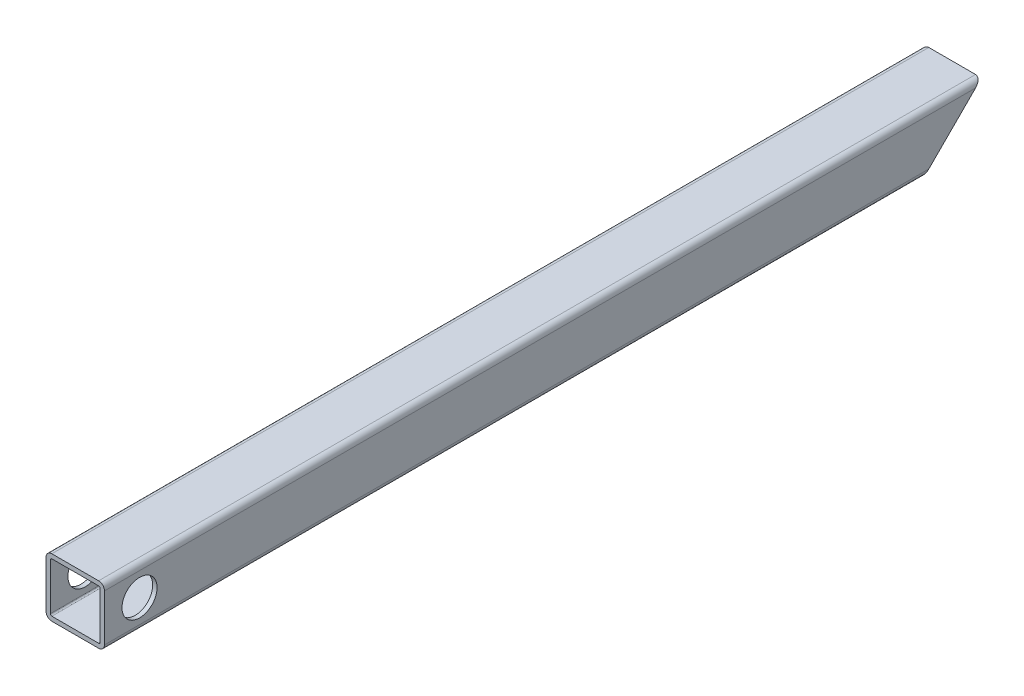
ISO-10303-21;
HEADER;
FILE_DESCRIPTION(('STEP AP214'),'2;1');
FILE_NAME('part.step','',(''),(''),'','','');
FILE_SCHEMA(('AUTOMOTIVE_DESIGN { 1 0 10303 214 1 1 1 1 }'));
ENDSEC;
DATA;
#1=APPLICATION_CONTEXT('core data for automotive mechanical design processes');
#2=APPLICATION_PROTOCOL_DEFINITION('international standard','automotive_design',2000,#1);
#3=PRODUCT_CONTEXT('',#1,'mechanical');
#4=PRODUCT('Part','Part','',(#3));
#5=PRODUCT_RELATED_PRODUCT_CATEGORY('part','',(#4));
#6=PRODUCT_DEFINITION_FORMATION('','',#4);
#7=PRODUCT_DEFINITION_CONTEXT('part definition',#1,'design');
#8=PRODUCT_DEFINITION('design','',#6,#7);
#9=PRODUCT_DEFINITION_SHAPE('','',#8);
#10=(LENGTH_UNIT() NAMED_UNIT(*) SI_UNIT(.MILLI.,.METRE.));
#11=(NAMED_UNIT(*) PLANE_ANGLE_UNIT() SI_UNIT($,.RADIAN.));
#12=(NAMED_UNIT(*) SI_UNIT($,.STERADIAN.) SOLID_ANGLE_UNIT());
#13=UNCERTAINTY_MEASURE_WITH_UNIT(LENGTH_MEASURE(1.E-05),#10,'distance_accuracy_value','');
#14=(GEOMETRIC_REPRESENTATION_CONTEXT(3) GLOBAL_UNCERTAINTY_ASSIGNED_CONTEXT((#13)) GLOBAL_UNIT_ASSIGNED_CONTEXT((#10,
#11,#12)) REPRESENTATION_CONTEXT('',''));
#15=CARTESIAN_POINT('',(0.,0.,0.));
#16=DIRECTION('',(0.,0.,1.));
#17=DIRECTION('',(1.,0.,0.));
#18=AXIS2_PLACEMENT_3D('',#15,#16,#17);
#19=CARTESIAN_POINT('',(-10.,0.,300.));
#20=DIRECTION('',(1.,0.,0.));
#21=DIRECTION('',(0.,0.,-1.));
#22=AXIS2_PLACEMENT_3D('',#19,#20,#21);
#23=PLANE('',#22);
#24=CARTESIAN_POINT('',(-10.,10.,288.));
#25=DIRECTION('',(1.,0.,0.));
#26=DIRECTION('',(0.,1.,0.));
#27=AXIS2_PLACEMENT_3D('',#24,#25,#26);
#28=CIRCLE('',#27,5.99999999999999);
#29=CARTESIAN_POINT('',(-10.,16.,288.));
#30=VERTEX_POINT('',#29);
#31=EDGE_CURVE('E459',#30,#30,#28,.T.);
#32=ORIENTED_EDGE('',*,*,#31,.T.);
#33=EDGE_LOOP('',(#32));
#34=FACE_BOUND('',#33,.T.);
#35=DIRECTION('',(0.,0.707106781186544,-0.707106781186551));
#36=VECTOR('',#35,1.);
#37=CARTESIAN_POINT('',(-10.,-140.,160.000000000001));
#38=LINE('',#37,#36);
#39=CARTESIAN_POINT('',(-10.,2.,18.0000000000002));
#40=VERTEX_POINT('',#39);
#41=CARTESIAN_POINT('',(-10.,18.,2.));
#42=VERTEX_POINT('',#41);
#43=EDGE_CURVE('E254',#40,#42,#38,.T.);
#44=ORIENTED_EDGE('',*,*,#43,.F.);
#45=DIRECTION('',(0.,0.,-1.));
#46=VECTOR('',#45,1.);
#47=CARTESIAN_POINT('',(-10.,2.,300.));
#48=LINE('',#47,#46);
#49=CARTESIAN_POINT('',(-10.,2.,300.));
#50=VERTEX_POINT('',#49);
#51=EDGE_CURVE('E188',#40,#50,#48,.F.);
#52=ORIENTED_EDGE('',*,*,#51,.T.);
#53=DIRECTION('',(0.,-1.,0.));
#54=VECTOR('',#53,1.);
#55=CARTESIAN_POINT('',(-10.,0.,300.));
#56=LINE('',#55,#54);
#57=CARTESIAN_POINT('',(-10.,18.,300.));
#58=VERTEX_POINT('',#57);
#59=EDGE_CURVE('E268',#58,#50,#56,.T.);
#60=ORIENTED_EDGE('',*,*,#59,.F.);
#61=DIRECTION('',(0.,0.,-1.));
#62=VECTOR('',#61,1.);
#63=CARTESIAN_POINT('',(-10.,18.,300.));
#64=LINE('',#63,#62);
#65=EDGE_CURVE('E185',#58,#42,#64,.T.);
#66=ORIENTED_EDGE('',*,*,#65,.T.);
#67=EDGE_LOOP('',(#44,#52,#60,#66));
#68=FACE_BOUND('',#67,.T.);
#69=ADVANCED_FACE('F32',(#34,#68),#23,.F.);
#70=CARTESIAN_POINT('',(-10.,0.,300.));
#71=DIRECTION('',(0.,1.,0.));
#72=DIRECTION('',(-1.,0.,0.));
#73=AXIS2_PLACEMENT_3D('',#70,#71,#72);
#74=PLANE('',#73);
#75=DIRECTION('',(1.,0.,0.));
#76=VECTOR('',#75,1.);
#77=CARTESIAN_POINT('',(-10.,0.,300.));
#78=LINE('',#77,#76);
#79=CARTESIAN_POINT('',(-8.,0.,300.));
#80=VERTEX_POINT('',#79);
#81=CARTESIAN_POINT('',(8.,0.,300.));
#82=VERTEX_POINT('',#81);
#83=EDGE_CURVE('E271',#80,#82,#78,.T.);
#84=ORIENTED_EDGE('',*,*,#83,.F.);
#85=DIRECTION('',(0.,0.,-1.));
#86=VECTOR('',#85,1.);
#87=CARTESIAN_POINT('',(-8.,0.,300.));
#88=LINE('',#87,#86);
#89=CARTESIAN_POINT('',(-8.00000000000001,0.,20.0000000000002));
#90=VERTEX_POINT('',#89);
#91=EDGE_CURVE('E165',#80,#90,#88,.T.);
#92=ORIENTED_EDGE('',*,*,#91,.T.);
#93=DIRECTION('',(-1.,0.,0.));
#94=VECTOR('',#93,1.);
#95=CARTESIAN_POINT('',(411.662979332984,0.,20.0000000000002));
#96=LINE('',#95,#94);
#97=CARTESIAN_POINT('',(8.00000000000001,0.,20.0000000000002));
#98=VERTEX_POINT('',#97);
#99=EDGE_CURVE('E148',#98,#90,#96,.T.);
#100=ORIENTED_EDGE('',*,*,#99,.F.);
#101=DIRECTION('',(0.,0.,-1.));
#102=VECTOR('',#101,1.);
#103=CARTESIAN_POINT('',(8.,0.,300.));
#104=LINE('',#103,#102);
#105=EDGE_CURVE('E162',#98,#82,#104,.F.);
#106=ORIENTED_EDGE('',*,*,#105,.T.);
#107=EDGE_LOOP('',(#84,#92,#100,#106));
#108=FACE_BOUND('',#107,.T.);
#109=ADVANCED_FACE('F161',(#108),#74,.F.);
#110=CARTESIAN_POINT('',(10.,0.,300.));
#111=DIRECTION('',(-1.,0.,0.));
#112=DIRECTION('',(0.,-1.,0.));
#113=AXIS2_PLACEMENT_3D('',#110,#111,#112);
#114=PLANE('',#113);
#115=CARTESIAN_POINT('',(10.,10.,288.));
#116=DIRECTION('',(1.,0.,0.));
#117=DIRECTION('',(0.,1.,0.));
#118=AXIS2_PLACEMENT_3D('',#115,#116,#117);
#119=CIRCLE('',#118,5.99999999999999);
#120=CARTESIAN_POINT('',(10.,16.,288.));
#121=VERTEX_POINT('',#120);
#122=EDGE_CURVE('E456',#121,#121,#119,.T.);
#123=ORIENTED_EDGE('',*,*,#122,.F.);
#124=EDGE_LOOP('',(#123));
#125=FACE_BOUND('',#124,.T.);
#126=DIRECTION('',(0.,1.,0.));
#127=VECTOR('',#126,1.);
#128=CARTESIAN_POINT('',(10.,0.,300.));
#129=LINE('',#128,#127);
#130=CARTESIAN_POINT('',(10.,2.,300.));
#131=VERTEX_POINT('',#130);
#132=CARTESIAN_POINT('',(10.,18.,300.));
#133=VERTEX_POINT('',#132);
#134=EDGE_CURVE('E273',#131,#133,#129,.T.);
#135=ORIENTED_EDGE('',*,*,#134,.F.);
#136=DIRECTION('',(0.,0.,-1.));
#137=VECTOR('',#136,1.);
#138=CARTESIAN_POINT('',(10.,2.,300.));
#139=LINE('',#138,#137);
#140=CARTESIAN_POINT('',(10.,2.,18.0000000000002));
#141=VERTEX_POINT('',#140);
#142=EDGE_CURVE('E199',#131,#141,#139,.T.);
#143=ORIENTED_EDGE('',*,*,#142,.T.);
#144=DIRECTION('',(0.,-0.707106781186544,0.707106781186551));
#145=VECTOR('',#144,1.);
#146=CARTESIAN_POINT('',(9.99999999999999,-140.,160.000000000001));
#147=LINE('',#146,#145);
#148=CARTESIAN_POINT('',(10.,18.,2.));
#149=VERTEX_POINT('',#148);
#150=EDGE_CURVE('E150',#149,#141,#147,.T.);
#151=ORIENTED_EDGE('',*,*,#150,.F.);
#152=DIRECTION('',(0.,0.,-1.));
#153=VECTOR('',#152,1.);
#154=CARTESIAN_POINT('',(10.,18.,300.));
#155=LINE('',#154,#153);
#156=EDGE_CURVE('E197',#149,#133,#155,.F.);
#157=ORIENTED_EDGE('',*,*,#156,.T.);
#158=EDGE_LOOP('',(#135,#143,#151,#157));
#159=FACE_BOUND('',#158,.T.);
#160=ADVANCED_FACE('F301',(#125,#159),#114,.F.);
#161=CARTESIAN_POINT('',(-8.5,1.5,300.));
#162=DIRECTION('',(1.,0.,0.));
#163=DIRECTION('',(0.,0.,-1.));
#164=AXIS2_PLACEMENT_3D('',#161,#162,#163);
#165=PLANE('',#164);
#166=CARTESIAN_POINT('',(-8.5,10.,288.));
#167=DIRECTION('',(1.,0.,0.));
#168=DIRECTION('',(0.,0.,-1.));
#169=AXIS2_PLACEMENT_3D('',#166,#167,#168);
#170=CIRCLE('',#169,5.99999999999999);
#171=CARTESIAN_POINT('',(-8.5,10.,282.));
#172=VERTEX_POINT('',#171);
#173=EDGE_CURVE('E167',#172,#172,#170,.T.);
#174=ORIENTED_EDGE('',*,*,#173,.F.);
#175=EDGE_LOOP('',(#174));
#176=FACE_BOUND('',#175,.T.);
#177=DIRECTION('',(0.,0.707106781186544,-0.707106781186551));
#178=VECTOR('',#177,1.);
#179=CARTESIAN_POINT('',(-8.5,-139.25,159.250000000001));
#180=LINE('',#179,#178);
#181=CARTESIAN_POINT('',(-8.5,2.,18.0000000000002));
#182=VERTEX_POINT('',#181);
#183=CARTESIAN_POINT('',(-8.5,18.,2.00000000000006));
#184=VERTEX_POINT('',#183);
#185=EDGE_CURVE('E241',#182,#184,#180,.T.);
#186=ORIENTED_EDGE('',*,*,#185,.T.);
#187=DIRECTION('',(0.,0.,-1.));
#188=VECTOR('',#187,1.);
#189=CARTESIAN_POINT('',(-8.5,18.,300.));
#190=LINE('',#189,#188);
#191=CARTESIAN_POINT('',(-8.5,18.,300.));
#192=VERTEX_POINT('',#191);
#193=EDGE_CURVE('E52',#184,#192,#190,.F.);
#194=ORIENTED_EDGE('',*,*,#193,.T.);
#195=DIRECTION('',(0.,-1.,0.));
#196=VECTOR('',#195,1.);
#197=CARTESIAN_POINT('',(-8.5,1.5,300.));
#198=LINE('',#197,#196);
#199=CARTESIAN_POINT('',(-8.5,2.,300.));
#200=VERTEX_POINT('',#199);
#201=EDGE_CURVE('E251',#192,#200,#198,.T.);
#202=ORIENTED_EDGE('',*,*,#201,.T.);
#203=DIRECTION('',(0.,0.,-1.));
#204=VECTOR('',#203,1.);
#205=CARTESIAN_POINT('',(-8.5,2.,18.5000000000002));
#206=LINE('',#205,#204);
#207=EDGE_CURVE('E221',#200,#182,#206,.T.);
#208=ORIENTED_EDGE('',*,*,#207,.T.);
#209=EDGE_LOOP('',(#186,#194,#202,#208));
#210=FACE_BOUND('',#209,.T.);
#211=ADVANCED_FACE('F250',(#176,#210),#165,.T.);
#212=CARTESIAN_POINT('',(-8.5,1.5,300.));
#213=DIRECTION('',(0.,1.,0.));
#214=DIRECTION('',(0.,0.,1.));
#215=AXIS2_PLACEMENT_3D('',#212,#213,#214);
#216=PLANE('',#215);
#217=DIRECTION('',(1.,0.,0.));
#218=VECTOR('',#217,1.);
#219=CARTESIAN_POINT('',(-8.5,1.5,300.));
#220=LINE('',#219,#218);
#221=CARTESIAN_POINT('',(-8.,1.5,300.));
#222=VERTEX_POINT('',#221);
#223=CARTESIAN_POINT('',(8.,1.5,300.));
#224=VERTEX_POINT('',#223);
#225=EDGE_CURVE('E253',#222,#224,#220,.T.);
#226=ORIENTED_EDGE('',*,*,#225,.T.);
#227=DIRECTION('',(0.,0.,-1.));
#228=VECTOR('',#227,1.);
#229=CARTESIAN_POINT('',(8.,1.5,18.5000000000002));
#230=LINE('',#229,#228);
#231=CARTESIAN_POINT('',(8.,1.5,18.5000000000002));
#232=VERTEX_POINT('',#231);
#233=EDGE_CURVE('E208',#224,#232,#230,.T.);
#234=ORIENTED_EDGE('',*,*,#233,.T.);
#235=DIRECTION('',(-1.,0.,0.));
#236=VECTOR('',#235,1.);
#237=CARTESIAN_POINT('',(-8.50000000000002,1.5,18.5000000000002));
#238=LINE('',#237,#236);
#239=CARTESIAN_POINT('',(-8.,1.5,18.5000000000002));
#240=VERTEX_POINT('',#239);
#241=EDGE_CURVE('E240',#232,#240,#238,.T.);
#242=ORIENTED_EDGE('',*,*,#241,.T.);
#243=DIRECTION('',(0.,0.,-1.));
#244=VECTOR('',#243,1.);
#245=CARTESIAN_POINT('',(-8.,1.5,300.));
#246=LINE('',#245,#244);
#247=EDGE_CURVE('E206',#240,#222,#246,.F.);
#248=ORIENTED_EDGE('',*,*,#247,.T.);
#249=EDGE_LOOP('',(#226,#234,#242,#248));
#250=FACE_BOUND('',#249,.T.);
#251=ADVANCED_FACE('F247',(#250),#216,.T.);
#252=CARTESIAN_POINT('',(8.5,1.5,300.));
#253=DIRECTION('',(-1.,0.,0.));
#254=DIRECTION('',(0.,0.,1.));
#255=AXIS2_PLACEMENT_3D('',#252,#253,#254);
#256=PLANE('',#255);
#257=CARTESIAN_POINT('',(8.5,10.,288.));
#258=DIRECTION('',(-1.,0.,0.));
#259=DIRECTION('',(0.,0.,1.));
#260=AXIS2_PLACEMENT_3D('',#257,#258,#259);
#261=CIRCLE('',#260,5.99999999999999);
#262=CARTESIAN_POINT('',(8.5,10.,294.));
#263=VERTEX_POINT('',#262);
#264=EDGE_CURVE('E180',#263,#263,#261,.T.);
#265=ORIENTED_EDGE('',*,*,#264,.F.);
#266=EDGE_LOOP('',(#265));
#267=FACE_BOUND('',#266,.T.);
#268=DIRECTION('',(0.,-0.707106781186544,0.707106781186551));
#269=VECTOR('',#268,1.);
#270=CARTESIAN_POINT('',(8.5,-139.25,159.250000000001));
#271=LINE('',#270,#269);
#272=CARTESIAN_POINT('',(8.5,18.,2.00000000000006));
#273=VERTEX_POINT('',#272);
#274=CARTESIAN_POINT('',(8.5,2.,18.0000000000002));
#275=VERTEX_POINT('',#274);
#276=EDGE_CURVE('E166',#273,#275,#271,.T.);
#277=ORIENTED_EDGE('',*,*,#276,.T.);
#278=DIRECTION('',(0.,0.,-1.));
#279=VECTOR('',#278,1.);
#280=CARTESIAN_POINT('',(8.5,2.,300.));
#281=LINE('',#280,#279);
#282=CARTESIAN_POINT('',(8.5,2.,300.));
#283=VERTEX_POINT('',#282);
#284=EDGE_CURVE('E214',#275,#283,#281,.F.);
#285=ORIENTED_EDGE('',*,*,#284,.T.);
#286=DIRECTION('',(0.,1.,0.));
#287=VECTOR('',#286,1.);
#288=CARTESIAN_POINT('',(8.5,1.5,300.));
#289=LINE('',#288,#287);
#290=CARTESIAN_POINT('',(8.5,18.,300.));
#291=VERTEX_POINT('',#290);
#292=EDGE_CURVE('E256',#283,#291,#289,.T.);
#293=ORIENTED_EDGE('',*,*,#292,.T.);
#294=DIRECTION('',(0.,0.,-1.));
#295=VECTOR('',#294,1.);
#296=CARTESIAN_POINT('',(8.5,18.,1.5));
#297=LINE('',#296,#295);
#298=EDGE_CURVE('E211',#291,#273,#297,.T.);
#299=ORIENTED_EDGE('',*,*,#298,.T.);
#300=EDGE_LOOP('',(#277,#285,#293,#299));
#301=FACE_BOUND('',#300,.T.);
#302=ADVANCED_FACE('F364',(#267,#301),#256,.T.);
#303=CARTESIAN_POINT('',(-8.5,18.5,300.));
#304=DIRECTION('',(0.,-1.,0.));
#305=DIRECTION('',(0.,0.,-1.));
#306=AXIS2_PLACEMENT_3D('',#303,#304,#305);
#307=PLANE('',#306);
#308=DIRECTION('',(1.,0.,0.));
#309=VECTOR('',#308,1.);
#310=CARTESIAN_POINT('',(-8.50000000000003,18.5,1.50000000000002));
#311=LINE('',#310,#309);
#312=CARTESIAN_POINT('',(-8.,18.5,1.50000000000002));
#313=VERTEX_POINT('',#312);
#314=CARTESIAN_POINT('',(8.,18.5,1.50000000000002));
#315=VERTEX_POINT('',#314);
#316=EDGE_CURVE('E172',#313,#315,#311,.T.);
#317=ORIENTED_EDGE('',*,*,#316,.T.);
#318=DIRECTION('',(0.,0.,-1.));
#319=VECTOR('',#318,1.);
#320=CARTESIAN_POINT('',(8.,18.5,300.));
#321=LINE('',#320,#319);
#322=CARTESIAN_POINT('',(8.,18.5,300.));
#323=VERTEX_POINT('',#322);
#324=EDGE_CURVE('E219',#315,#323,#321,.F.);
#325=ORIENTED_EDGE('',*,*,#324,.T.);
#326=DIRECTION('',(-1.,0.,0.));
#327=VECTOR('',#326,1.);
#328=CARTESIAN_POINT('',(-8.5,18.5,300.));
#329=LINE('',#328,#327);
#330=CARTESIAN_POINT('',(-8.,18.5,300.));
#331=VERTEX_POINT('',#330);
#332=EDGE_CURVE('E264',#323,#331,#329,.T.);
#333=ORIENTED_EDGE('',*,*,#332,.T.);
#334=DIRECTION('',(0.,0.,-1.));
#335=VECTOR('',#334,1.);
#336=CARTESIAN_POINT('',(-8.,18.5,1.5));
#337=LINE('',#336,#335);
#338=EDGE_CURVE('E216',#331,#313,#337,.T.);
#339=ORIENTED_EDGE('',*,*,#338,.T.);
#340=EDGE_LOOP('',(#317,#325,#333,#339));
#341=FACE_BOUND('',#340,.T.);
#342=ADVANCED_FACE('F373',(#341),#307,.T.);
#343=CARTESIAN_POINT('',(-10.,20.,300.));
#344=DIRECTION('',(0.,0.,-1.));
#345=DIRECTION('',(-1.,0.,0.));
#346=AXIS2_PLACEMENT_3D('',#343,#344,#345);
#347=PLANE('',#346);
#348=ORIENTED_EDGE('',*,*,#59,.T.);
#349=CARTESIAN_POINT('',(-8.,2.,300.));
#350=DIRECTION('',(0.,0.,-1.));
#351=DIRECTION('',(-1.,0.,0.));
#352=AXIS2_PLACEMENT_3D('',#349,#350,#351);
#353=CIRCLE('',#352,2.);
#354=EDGE_CURVE('E195',#50,#80,#353,.F.);
#355=ORIENTED_EDGE('',*,*,#354,.T.);
#356=ORIENTED_EDGE('',*,*,#83,.T.);
#357=CARTESIAN_POINT('',(8.,2.,300.));
#358=DIRECTION('',(0.,0.,-1.));
#359=DIRECTION('',(-1.,0.,0.));
#360=AXIS2_PLACEMENT_3D('',#357,#358,#359);
#361=CIRCLE('',#360,2.);
#362=EDGE_CURVE('E171',#82,#131,#361,.F.);
#363=ORIENTED_EDGE('',*,*,#362,.T.);
#364=ORIENTED_EDGE('',*,*,#134,.T.);
#365=CARTESIAN_POINT('',(8.,18.,300.));
#366=DIRECTION('',(0.,0.,-1.));
#367=DIRECTION('',(-1.,0.,0.));
#368=AXIS2_PLACEMENT_3D('',#365,#366,#367);
#369=CIRCLE('',#368,2.);
#370=CARTESIAN_POINT('',(8.,20.,300.));
#371=VERTEX_POINT('',#370);
#372=EDGE_CURVE('E190',#133,#371,#369,.F.);
#373=ORIENTED_EDGE('',*,*,#372,.T.);
#374=DIRECTION('',(-1.,0.,0.));
#375=VECTOR('',#374,1.);
#376=CARTESIAN_POINT('',(-10.,20.,300.));
#377=LINE('',#376,#375);
#378=CARTESIAN_POINT('',(-8.,20.,300.));
#379=VERTEX_POINT('',#378);
#380=EDGE_CURVE('E177',#371,#379,#377,.T.);
#381=ORIENTED_EDGE('',*,*,#380,.T.);
#382=CARTESIAN_POINT('',(-8.,18.,300.));
#383=DIRECTION('',(0.,0.,-1.));
#384=DIRECTION('',(-1.,0.,0.));
#385=AXIS2_PLACEMENT_3D('',#382,#383,#384);
#386=CIRCLE('',#385,2.);
#387=EDGE_CURVE('E192',#379,#58,#386,.F.);
#388=ORIENTED_EDGE('',*,*,#387,.T.);
#389=EDGE_LOOP('',(#348,#355,#356,#363,#364,#373,#381,#388));
#390=FACE_BOUND('',#389,.T.);
#391=ORIENTED_EDGE('',*,*,#201,.F.);
#392=CARTESIAN_POINT('',(-8.,18.,300.));
#393=DIRECTION('',(0.,0.,-1.));
#394=DIRECTION('',(-1.,0.,0.));
#395=AXIS2_PLACEMENT_3D('',#392,#393,#394);
#396=CIRCLE('',#395,0.5);
#397=EDGE_CURVE('E235',#192,#331,#396,.T.);
#398=ORIENTED_EDGE('',*,*,#397,.T.);
#399=ORIENTED_EDGE('',*,*,#332,.F.);
#400=CARTESIAN_POINT('',(8.,18.,300.));
#401=DIRECTION('',(0.,0.,-1.));
#402=DIRECTION('',(-1.,0.,0.));
#403=AXIS2_PLACEMENT_3D('',#400,#401,#402);
#404=CIRCLE('',#403,0.5);
#405=EDGE_CURVE('E231',#323,#291,#404,.T.);
#406=ORIENTED_EDGE('',*,*,#405,.T.);
#407=ORIENTED_EDGE('',*,*,#292,.F.);
#408=CARTESIAN_POINT('',(8.,2.,300.));
#409=DIRECTION('',(0.,0.,-1.));
#410=DIRECTION('',(-1.,0.,0.));
#411=AXIS2_PLACEMENT_3D('',#408,#409,#410);
#412=CIRCLE('',#411,0.5);
#413=EDGE_CURVE('E227',#283,#224,#412,.T.);
#414=ORIENTED_EDGE('',*,*,#413,.T.);
#415=ORIENTED_EDGE('',*,*,#225,.F.);
#416=CARTESIAN_POINT('',(-8.,2.,300.));
#417=DIRECTION('',(0.,0.,-1.));
#418=DIRECTION('',(-1.,0.,0.));
#419=AXIS2_PLACEMENT_3D('',#416,#417,#418);
#420=CIRCLE('',#419,0.5);
#421=EDGE_CURVE('E11',#222,#200,#420,.T.);
#422=ORIENTED_EDGE('',*,*,#421,.T.);
#423=EDGE_LOOP('',(#391,#398,#399,#406,#407,#414,#415,#422));
#424=FACE_BOUND('',#423,.T.);
#425=ADVANCED_FACE('F291',(#390,#424),#347,.F.);
#426=CARTESIAN_POINT('',(-10.,20.,300.));
#427=DIRECTION('',(0.,-1.,0.));
#428=DIRECTION('',(0.,0.,-1.));
#429=AXIS2_PLACEMENT_3D('',#426,#427,#428);
#430=PLANE('',#429);
#431=DIRECTION('',(-1.,0.,0.));
#432=VECTOR('',#431,1.);
#433=CARTESIAN_POINT('',(-10.,20.,0.));
#434=LINE('',#433,#432);
#435=CARTESIAN_POINT('',(8.,20.,0.));
#436=VERTEX_POINT('',#435);
#437=CARTESIAN_POINT('',(-8.,20.,0.));
#438=VERTEX_POINT('',#437);
#439=EDGE_CURVE('E267',#436,#438,#434,.T.);
#440=ORIENTED_EDGE('',*,*,#439,.T.);
#441=DIRECTION('',(0.,0.,-1.));
#442=VECTOR('',#441,1.);
#443=CARTESIAN_POINT('',(-8.,20.,300.));
#444=LINE('',#443,#442);
#445=EDGE_CURVE('E204',#438,#379,#444,.F.);
#446=ORIENTED_EDGE('',*,*,#445,.T.);
#447=ORIENTED_EDGE('',*,*,#380,.F.);
#448=DIRECTION('',(0.,0.,-1.));
#449=VECTOR('',#448,1.);
#450=CARTESIAN_POINT('',(8.,20.,300.));
#451=LINE('',#450,#449);
#452=EDGE_CURVE('E201',#371,#436,#451,.T.);
#453=ORIENTED_EDGE('',*,*,#452,.T.);
#454=EDGE_LOOP('',(#440,#446,#447,#453));
#455=FACE_BOUND('',#454,.T.);
#456=ADVANCED_FACE('F282',(#455),#430,.F.);
#457=CARTESIAN_POINT('',(411.662979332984,20.,0.));
#458=DIRECTION('',(0.,-0.707106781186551,-0.707106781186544));
#459=DIRECTION('',(0.,0.707106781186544,-0.707106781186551));
#460=AXIS2_PLACEMENT_3D('',#457,#458,#459);
#461=PLANE('',#460);
#462=ORIENTED_EDGE('',*,*,#185,.F.);
#463=CARTESIAN_POINT('',(-8.,2.,18.0000000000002));
#464=DIRECTION('',(0.,-0.707106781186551,-0.707106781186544));
#465=DIRECTION('',(0.,-0.707106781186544,0.707106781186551));
#466=AXIS2_PLACEMENT_3D('',#463,#464,#465);
#467=ELLIPSE('',#466,0.707106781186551,0.5);
#468=EDGE_CURVE('E40',#182,#240,#467,.F.);
#469=ORIENTED_EDGE('',*,*,#468,.T.);
#470=ORIENTED_EDGE('',*,*,#241,.F.);
#471=CARTESIAN_POINT('',(8.,2.,18.0000000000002));
#472=DIRECTION('',(0.,-0.707106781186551,-0.707106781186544));
#473=DIRECTION('',(0.,-0.707106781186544,0.707106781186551));
#474=AXIS2_PLACEMENT_3D('',#471,#472,#473);
#475=ELLIPSE('',#474,0.707106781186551,0.5);
#476=EDGE_CURVE('E225',#232,#275,#475,.F.);
#477=ORIENTED_EDGE('',*,*,#476,.T.);
#478=ORIENTED_EDGE('',*,*,#276,.F.);
#479=CARTESIAN_POINT('',(8.,18.,2.00000000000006));
#480=DIRECTION('',(0.,-0.707106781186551,-0.707106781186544));
#481=DIRECTION('',(0.,-0.707106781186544,0.707106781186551));
#482=AXIS2_PLACEMENT_3D('',#479,#480,#481);
#483=ELLIPSE('',#482,0.707106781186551,0.5);
#484=EDGE_CURVE('E229',#273,#315,#483,.F.);
#485=ORIENTED_EDGE('',*,*,#484,.T.);
#486=ORIENTED_EDGE('',*,*,#316,.F.);
#487=CARTESIAN_POINT('',(-8.,18.,2.00000000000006));
#488=DIRECTION('',(0.,-0.707106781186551,-0.707106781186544));
#489=DIRECTION('',(0.,-0.707106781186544,0.707106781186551));
#490=AXIS2_PLACEMENT_3D('',#487,#488,#489);
#491=ELLIPSE('',#490,0.707106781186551,0.5);
#492=EDGE_CURVE('E233',#313,#184,#491,.F.);
#493=ORIENTED_EDGE('',*,*,#492,.T.);
#494=EDGE_LOOP('',(#462,#469,#470,#477,#478,#485,#486,#493));
#495=FACE_BOUND('',#494,.T.);
#496=ORIENTED_EDGE('',*,*,#99,.T.);
#497=CARTESIAN_POINT('',(-8.,2.,18.0000000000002));
#498=DIRECTION('',(0.,-0.707106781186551,-0.707106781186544));
#499=DIRECTION('',(0.,0.707106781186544,-0.707106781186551));
#500=AXIS2_PLACEMENT_3D('',#497,#498,#499);
#501=ELLIPSE('',#500,2.8284271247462,2.);
#502=EDGE_CURVE('E155',#90,#40,#501,.T.);
#503=ORIENTED_EDGE('',*,*,#502,.T.);
#504=ORIENTED_EDGE('',*,*,#43,.T.);
#505=CARTESIAN_POINT('',(-8.,18.,2.00000000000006));
#506=DIRECTION('',(0.,-0.707106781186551,-0.707106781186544));
#507=DIRECTION('',(0.,0.707106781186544,-0.707106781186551));
#508=AXIS2_PLACEMENT_3D('',#505,#506,#507);
#509=ELLIPSE('',#508,2.8284271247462,2.);
#510=EDGE_CURVE('E156',#42,#438,#509,.T.);
#511=ORIENTED_EDGE('',*,*,#510,.T.);
#512=ORIENTED_EDGE('',*,*,#439,.F.);
#513=CARTESIAN_POINT('',(8.,18.,2.00000000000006));
#514=DIRECTION('',(0.,-0.707106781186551,-0.707106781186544));
#515=DIRECTION('',(0.,0.707106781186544,-0.707106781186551));
#516=AXIS2_PLACEMENT_3D('',#513,#514,#515);
#517=ELLIPSE('',#516,2.8284271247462,2.);
#518=EDGE_CURVE('E174',#436,#149,#517,.T.);
#519=ORIENTED_EDGE('',*,*,#518,.T.);
#520=ORIENTED_EDGE('',*,*,#150,.T.);
#521=CARTESIAN_POINT('',(8.,2.,18.0000000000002));
#522=DIRECTION('',(0.,-0.707106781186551,-0.707106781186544));
#523=DIRECTION('',(0.,0.707106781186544,-0.707106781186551));
#524=AXIS2_PLACEMENT_3D('',#521,#522,#523);
#525=ELLIPSE('',#524,2.8284271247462,2.);
#526=EDGE_CURVE('E145',#141,#98,#525,.T.);
#527=ORIENTED_EDGE('',*,*,#526,.T.);
#528=EDGE_LOOP('',(#496,#503,#504,#511,#512,#519,#520,#527));
#529=FACE_BOUND('',#528,.T.);
#530=ADVANCED_FACE('F147',(#495,#529),#461,.T.);
#531=CARTESIAN_POINT('',(-10.,10.,288.));
#532=DIRECTION('',(1.,0.,0.));
#533=DIRECTION('',(0.,1.,0.));
#534=AXIS2_PLACEMENT_3D('',#531,#532,#533);
#535=CYLINDRICAL_SURFACE('',#534,5.99999999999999);
#536=ORIENTED_EDGE('',*,*,#264,.T.);
#537=EDGE_LOOP('',(#536));
#538=FACE_BOUND('',#537,.T.);
#539=ORIENTED_EDGE('',*,*,#122,.T.);
#540=EDGE_LOOP('',(#539));
#541=FACE_BOUND('',#540,.T.);
#542=ADVANCED_FACE('F402',(#538,#541),#535,.F.);
#543=ORIENTED_EDGE('',*,*,#173,.T.);
#544=EDGE_LOOP('',(#543));
#545=FACE_BOUND('',#544,.T.);
#546=ORIENTED_EDGE('',*,*,#31,.F.);
#547=EDGE_LOOP('',(#546));
#548=FACE_BOUND('',#547,.T.);
#549=ADVANCED_FACE('F328',(#545,#548),#535,.F.);
#550=CARTESIAN_POINT('',(-8.,2.,300.));
#551=DIRECTION('',(0.,0.,-1.));
#552=DIRECTION('',(-1.,0.,0.));
#553=AXIS2_PLACEMENT_3D('',#550,#551,#552);
#554=CYLINDRICAL_SURFACE('',#553,2.);
#555=ORIENTED_EDGE('',*,*,#354,.F.);
#556=ORIENTED_EDGE('',*,*,#51,.F.);
#557=ORIENTED_EDGE('',*,*,#502,.F.);
#558=ORIENTED_EDGE('',*,*,#91,.F.);
#559=EDGE_LOOP('',(#555,#556,#557,#558));
#560=FACE_BOUND('',#559,.T.);
#561=ADVANCED_FACE('F297',(#560),#554,.T.);
#562=CARTESIAN_POINT('',(8.,2.,300.));
#563=DIRECTION('',(0.,0.,-1.));
#564=DIRECTION('',(-1.,0.,0.));
#565=AXIS2_PLACEMENT_3D('',#562,#563,#564);
#566=CYLINDRICAL_SURFACE('',#565,2.);
#567=ORIENTED_EDGE('',*,*,#362,.F.);
#568=ORIENTED_EDGE('',*,*,#105,.F.);
#569=ORIENTED_EDGE('',*,*,#526,.F.);
#570=ORIENTED_EDGE('',*,*,#142,.F.);
#571=EDGE_LOOP('',(#567,#568,#569,#570));
#572=FACE_BOUND('',#571,.T.);
#573=ADVANCED_FACE('F170',(#572),#566,.T.);
#574=CARTESIAN_POINT('',(-8.,18.,300.));
#575=DIRECTION('',(0.,0.,-1.));
#576=DIRECTION('',(-1.,0.,0.));
#577=AXIS2_PLACEMENT_3D('',#574,#575,#576);
#578=CYLINDRICAL_SURFACE('',#577,2.);
#579=ORIENTED_EDGE('',*,*,#387,.F.);
#580=ORIENTED_EDGE('',*,*,#445,.F.);
#581=ORIENTED_EDGE('',*,*,#510,.F.);
#582=ORIENTED_EDGE('',*,*,#65,.F.);
#583=EDGE_LOOP('',(#579,#580,#581,#582));
#584=FACE_BOUND('',#583,.T.);
#585=ADVANCED_FACE('F287',(#584),#578,.T.);
#586=CARTESIAN_POINT('',(8.,18.,300.));
#587=DIRECTION('',(0.,0.,-1.));
#588=DIRECTION('',(-1.,0.,0.));
#589=AXIS2_PLACEMENT_3D('',#586,#587,#588);
#590=CYLINDRICAL_SURFACE('',#589,2.);
#591=ORIENTED_EDGE('',*,*,#372,.F.);
#592=ORIENTED_EDGE('',*,*,#156,.F.);
#593=ORIENTED_EDGE('',*,*,#518,.F.);
#594=ORIENTED_EDGE('',*,*,#452,.F.);
#595=EDGE_LOOP('',(#591,#592,#593,#594));
#596=FACE_BOUND('',#595,.T.);
#597=ADVANCED_FACE('F304',(#596),#590,.T.);
#598=CARTESIAN_POINT('',(8.,2.,300.));
#599=DIRECTION('',(0.,0.,1.));
#600=DIRECTION('',(1.,0.,0.));
#601=AXIS2_PLACEMENT_3D('',#598,#599,#600);
#602=CYLINDRICAL_SURFACE('',#601,0.5);
#603=ORIENTED_EDGE('',*,*,#413,.F.);
#604=ORIENTED_EDGE('',*,*,#284,.F.);
#605=ORIENTED_EDGE('',*,*,#476,.F.);
#606=ORIENTED_EDGE('',*,*,#233,.F.);
#607=EDGE_LOOP('',(#603,#604,#605,#606));
#608=FACE_BOUND('',#607,.T.);
#609=ADVANCED_FACE('F306',(#608),#602,.F.);
#610=CARTESIAN_POINT('',(8.,18.,300.));
#611=DIRECTION('',(0.,0.,1.));
#612=DIRECTION('',(1.,0.,0.));
#613=AXIS2_PLACEMENT_3D('',#610,#611,#612);
#614=CYLINDRICAL_SURFACE('',#613,0.5);
#615=ORIENTED_EDGE('',*,*,#405,.F.);
#616=ORIENTED_EDGE('',*,*,#324,.F.);
#617=ORIENTED_EDGE('',*,*,#484,.F.);
#618=ORIENTED_EDGE('',*,*,#298,.F.);
#619=EDGE_LOOP('',(#615,#616,#617,#618));
#620=FACE_BOUND('',#619,.T.);
#621=ADVANCED_FACE('F312',(#620),#614,.F.);
#622=CARTESIAN_POINT('',(-8.,18.,300.));
#623=DIRECTION('',(0.,0.,1.));
#624=DIRECTION('',(1.,0.,0.));
#625=AXIS2_PLACEMENT_3D('',#622,#623,#624);
#626=CYLINDRICAL_SURFACE('',#625,0.5);
#627=ORIENTED_EDGE('',*,*,#397,.F.);
#628=ORIENTED_EDGE('',*,*,#193,.F.);
#629=ORIENTED_EDGE('',*,*,#492,.F.);
#630=ORIENTED_EDGE('',*,*,#338,.F.);
#631=EDGE_LOOP('',(#627,#628,#629,#630));
#632=FACE_BOUND('',#631,.T.);
#633=ADVANCED_FACE('F419',(#632),#626,.F.);
#634=CARTESIAN_POINT('',(-8.,2.,300.));
#635=DIRECTION('',(0.,0.,1.));
#636=DIRECTION('',(1.,0.,0.));
#637=AXIS2_PLACEMENT_3D('',#634,#635,#636);
#638=CYLINDRICAL_SURFACE('',#637,0.5);
#639=ORIENTED_EDGE('',*,*,#421,.F.);
#640=ORIENTED_EDGE('',*,*,#247,.F.);
#641=ORIENTED_EDGE('',*,*,#468,.F.);
#642=ORIENTED_EDGE('',*,*,#207,.F.);
#643=EDGE_LOOP('',(#639,#640,#641,#642));
#644=FACE_BOUND('',#643,.T.);
#645=ADVANCED_FACE('F34',(#644),#638,.F.);
#646=CLOSED_SHELL('',(#69,#109,#160,#211,#251,#302,#342,#425,#456,#530,#542,#549,#561,#573,#585,
#597,#609,#621,#633,#645));
#647=MANIFOLD_SOLID_BREP('B2',#646);
#648=ADVANCED_BREP_SHAPE_REPRESENTATION('',(#18,#647),#14);
#649=SHAPE_DEFINITION_REPRESENTATION(#9,#648);
ENDSEC;
END-ISO-10303-21;
